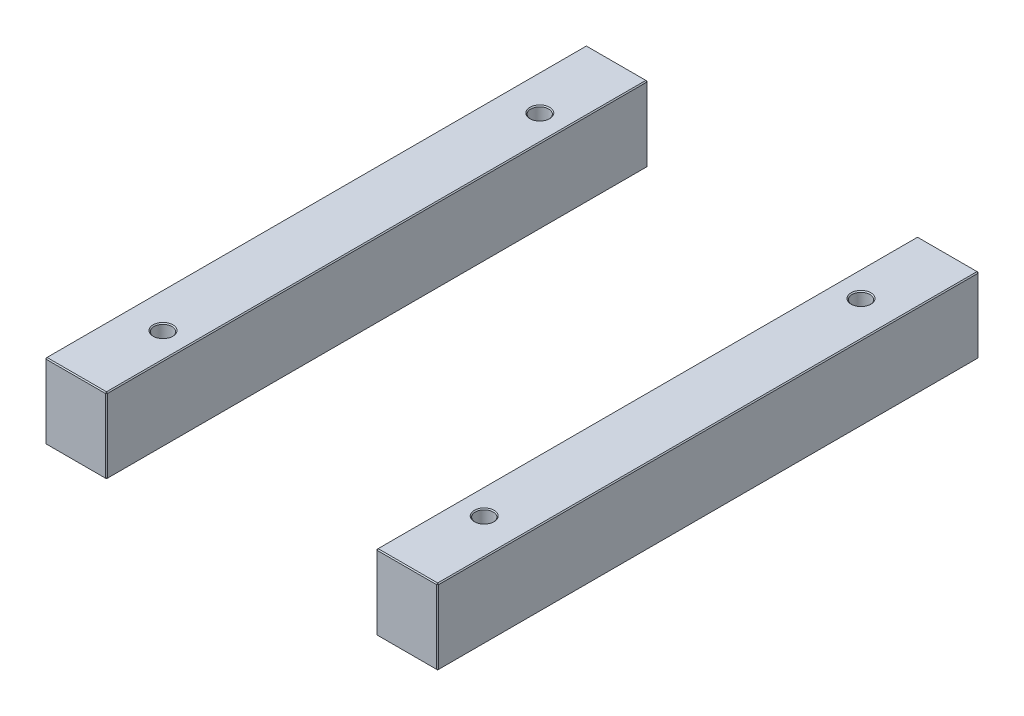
ISO-10303-21;
HEADER;
FILE_DESCRIPTION(('STEP AP214'),'2;1');
FILE_NAME('part.step','',(''),(''),'','','');
FILE_SCHEMA(('AUTOMOTIVE_DESIGN { 1 0 10303 214 1 1 1 1 }'));
ENDSEC;
DATA;
#1=APPLICATION_CONTEXT('core data for automotive mechanical design processes');
#2=APPLICATION_PROTOCOL_DEFINITION('international standard','automotive_design',2000,#1);
#3=PRODUCT_CONTEXT('',#1,'mechanical');
#4=PRODUCT('Part','Part','',(#3));
#5=PRODUCT_RELATED_PRODUCT_CATEGORY('part','',(#4));
#6=PRODUCT_DEFINITION_FORMATION('','',#4);
#7=PRODUCT_DEFINITION_CONTEXT('part definition',#1,'design');
#8=PRODUCT_DEFINITION('design','',#6,#7);
#9=PRODUCT_DEFINITION_SHAPE('','',#8);
#10=(LENGTH_UNIT() NAMED_UNIT(*) SI_UNIT(.MILLI.,.METRE.));
#11=(NAMED_UNIT(*) PLANE_ANGLE_UNIT() SI_UNIT($,.RADIAN.));
#12=(NAMED_UNIT(*) SI_UNIT($,.STERADIAN.) SOLID_ANGLE_UNIT());
#13=UNCERTAINTY_MEASURE_WITH_UNIT(LENGTH_MEASURE(1.E-05),#10,'distance_accuracy_value','');
#14=(GEOMETRIC_REPRESENTATION_CONTEXT(3) GLOBAL_UNCERTAINTY_ASSIGNED_CONTEXT((#13)) GLOBAL_UNIT_ASSIGNED_CONTEXT((#10,
#11,#12)) REPRESENTATION_CONTEXT('',''));
#15=CARTESIAN_POINT('',(0.,0.,0.));
#16=DIRECTION('',(0.,0.,1.));
#17=DIRECTION('',(1.,0.,0.));
#18=AXIS2_PLACEMENT_3D('',#15,#16,#17);
#19=CARTESIAN_POINT('',(-198.,76.,-273.));
#20=DIRECTION('',(0.,0.,1.));
#21=DIRECTION('',(1.,0.,0.));
#22=AXIS2_PLACEMENT_3D('',#19,#20,#21);
#23=PLANE('',#22);
#24=DIRECTION('',(-1.,0.,0.));
#25=VECTOR('',#24,1.);
#26=CARTESIAN_POINT('',(-198.,0.99999999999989,-273.));
#27=LINE('',#26,#25);
#28=CARTESIAN_POINT('',(-137.,0.99999999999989,-273.));
#29=VERTEX_POINT('',#28);
#30=CARTESIAN_POINT('',(-197.,0.99999999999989,-273.));
#31=VERTEX_POINT('',#30);
#32=EDGE_CURVE('P0_E137',#29,#31,#27,.T.);
#33=ORIENTED_EDGE('',*,*,#32,.T.);
#34=DIRECTION('',(0.,1.,0.));
#35=VECTOR('',#34,1.);
#36=CARTESIAN_POINT('',(-197.,76.,-273.));
#37=LINE('',#36,#35);
#38=CARTESIAN_POINT('',(-197.,75.,-273.));
#39=VERTEX_POINT('',#38);
#40=EDGE_CURVE('P0_E235',#31,#39,#37,.T.);
#41=ORIENTED_EDGE('',*,*,#40,.T.);
#42=DIRECTION('',(1.,0.,0.));
#43=VECTOR('',#42,1.);
#44=CARTESIAN_POINT('',(-198.,75.,-273.));
#45=LINE('',#44,#43);
#46=CARTESIAN_POINT('',(-137.,75.,-273.));
#47=VERTEX_POINT('',#46);
#48=EDGE_CURVE('P0_E233',#39,#47,#45,.T.);
#49=ORIENTED_EDGE('',*,*,#48,.T.);
#50=DIRECTION('',(0.,-1.,0.));
#51=VECTOR('',#50,1.);
#52=CARTESIAN_POINT('',(-137.,76.,-273.));
#53=LINE('',#52,#51);
#54=EDGE_CURVE('P0_E230',#47,#29,#53,.T.);
#55=ORIENTED_EDGE('',*,*,#54,.T.);
#56=EDGE_LOOP('',(#33,#41,#49,#55));
#57=FACE_BOUND('',#56,.T.);
#58=ADVANCED_FACE('P0_F16',(#57),#23,.F.);
#59=CARTESIAN_POINT('',(-198.,76.,273.));
#60=DIRECTION('',(1.,0.,0.));
#61=DIRECTION('',(0.,0.,-1.));
#62=AXIS2_PLACEMENT_3D('',#59,#60,#61);
#63=PLANE('',#62);
#64=DIRECTION('',(0.,1.,0.));
#65=VECTOR('',#64,1.);
#66=CARTESIAN_POINT('',(-198.,76.,272.));
#67=LINE('',#66,#65);
#68=CARTESIAN_POINT('',(-198.,0.99999999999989,272.));
#69=VERTEX_POINT('',#68);
#70=CARTESIAN_POINT('',(-198.,75.,272.));
#71=VERTEX_POINT('',#70);
#72=EDGE_CURVE('P0_E217',#69,#71,#67,.T.);
#73=ORIENTED_EDGE('',*,*,#72,.T.);
#74=DIRECTION('',(0.,0.,-1.));
#75=VECTOR('',#74,1.);
#76=CARTESIAN_POINT('',(-198.,75.,273.));
#77=LINE('',#76,#75);
#78=CARTESIAN_POINT('',(-198.,75.,-272.));
#79=VERTEX_POINT('',#78);
#80=EDGE_CURVE('P0_E228',#71,#79,#77,.T.);
#81=ORIENTED_EDGE('',*,*,#80,.T.);
#82=DIRECTION('',(0.,-1.,0.));
#83=VECTOR('',#82,1.);
#84=CARTESIAN_POINT('',(-198.,76.,-272.));
#85=LINE('',#84,#83);
#86=CARTESIAN_POINT('',(-198.,0.99999999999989,-272.));
#87=VERTEX_POINT('',#86);
#88=EDGE_CURVE('P0_E225',#79,#87,#85,.T.);
#89=ORIENTED_EDGE('',*,*,#88,.T.);
#90=DIRECTION('',(0.,0.,1.));
#91=VECTOR('',#90,1.);
#92=CARTESIAN_POINT('',(-198.,0.99999999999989,273.));
#93=LINE('',#92,#91);
#94=EDGE_CURVE('P0_E214',#87,#69,#93,.T.);
#95=ORIENTED_EDGE('',*,*,#94,.T.);
#96=EDGE_LOOP('',(#73,#81,#89,#95));
#97=FACE_BOUND('',#96,.T.);
#98=ADVANCED_FACE('P0_F302',(#97),#63,.F.);
#99=CARTESIAN_POINT('',(-198.,76.,273.));
#100=DIRECTION('',(0.,0.,-1.));
#101=DIRECTION('',(-1.,0.,0.));
#102=AXIS2_PLACEMENT_3D('',#99,#100,#101);
#103=PLANE('',#102);
#104=DIRECTION('',(-1.,0.,0.));
#105=VECTOR('',#104,1.);
#106=CARTESIAN_POINT('',(-198.,75.,273.));
#107=LINE('',#106,#105);
#108=CARTESIAN_POINT('',(-137.,75.,273.));
#109=VERTEX_POINT('',#108);
#110=CARTESIAN_POINT('',(-197.,75.,273.));
#111=VERTEX_POINT('',#110);
#112=EDGE_CURVE('P0_E242',#109,#111,#107,.T.);
#113=ORIENTED_EDGE('',*,*,#112,.T.);
#114=DIRECTION('',(0.,-1.,0.));
#115=VECTOR('',#114,1.);
#116=CARTESIAN_POINT('',(-197.,76.,273.));
#117=LINE('',#116,#115);
#118=CARTESIAN_POINT('',(-197.,0.99999999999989,273.));
#119=VERTEX_POINT('',#118);
#120=EDGE_CURVE('P0_E244',#111,#119,#117,.T.);
#121=ORIENTED_EDGE('',*,*,#120,.T.);
#122=DIRECTION('',(1.,0.,0.));
#123=VECTOR('',#122,1.);
#124=CARTESIAN_POINT('',(-136.,0.99999999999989,273.));
#125=LINE('',#124,#123);
#126=CARTESIAN_POINT('',(-137.,0.99999999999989,273.));
#127=VERTEX_POINT('',#126);
#128=EDGE_CURVE('P0_E240',#119,#127,#125,.T.);
#129=ORIENTED_EDGE('',*,*,#128,.T.);
#130=DIRECTION('',(0.,1.,0.));
#131=VECTOR('',#130,1.);
#132=CARTESIAN_POINT('',(-137.,76.,273.));
#133=LINE('',#132,#131);
#134=EDGE_CURVE('P0_E238',#127,#109,#133,.T.);
#135=ORIENTED_EDGE('',*,*,#134,.T.);
#136=EDGE_LOOP('',(#113,#121,#129,#135));
#137=FACE_BOUND('',#136,.T.);
#138=ADVANCED_FACE('P0_F341',(#137),#103,.F.);
#139=CARTESIAN_POINT('',(-136.,76.,-273.));
#140=DIRECTION('',(-1.,0.,0.));
#141=DIRECTION('',(0.,0.,1.));
#142=AXIS2_PLACEMENT_3D('',#139,#140,#141);
#143=PLANE('',#142);
#144=DIRECTION('',(0.,0.,1.));
#145=VECTOR('',#144,1.);
#146=CARTESIAN_POINT('',(-136.,75.,-273.));
#147=LINE('',#146,#145);
#148=CARTESIAN_POINT('',(-136.,75.,-272.));
#149=VERTEX_POINT('',#148);
#150=CARTESIAN_POINT('',(-136.,75.,272.));
#151=VERTEX_POINT('',#150);
#152=EDGE_CURVE('P0_E31',#149,#151,#147,.T.);
#153=ORIENTED_EDGE('',*,*,#152,.T.);
#154=DIRECTION('',(0.,-1.,0.));
#155=VECTOR('',#154,1.);
#156=CARTESIAN_POINT('',(-136.,76.,272.));
#157=LINE('',#156,#155);
#158=CARTESIAN_POINT('',(-136.,0.99999999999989,272.));
#159=VERTEX_POINT('',#158);
#160=EDGE_CURVE('P0_E190',#151,#159,#157,.T.);
#161=ORIENTED_EDGE('',*,*,#160,.T.);
#162=DIRECTION('',(0.,0.,-1.));
#163=VECTOR('',#162,1.);
#164=CARTESIAN_POINT('',(-136.,0.99999999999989,-273.));
#165=LINE('',#164,#163);
#166=CARTESIAN_POINT('',(-136.,0.99999999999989,-272.));
#167=VERTEX_POINT('',#166);
#168=EDGE_CURVE('P0_E256',#159,#167,#165,.T.);
#169=ORIENTED_EDGE('',*,*,#168,.T.);
#170=DIRECTION('',(0.,1.,0.));
#171=VECTOR('',#170,1.);
#172=CARTESIAN_POINT('',(-136.,76.,-272.));
#173=LINE('',#172,#171);
#174=EDGE_CURVE('P0_E36',#167,#149,#173,.T.);
#175=ORIENTED_EDGE('',*,*,#174,.T.);
#176=EDGE_LOOP('',(#153,#161,#169,#175));
#177=FACE_BOUND('',#176,.T.);
#178=ADVANCED_FACE('P0_F535',(#177),#143,.F.);
#179=CARTESIAN_POINT('',(0.,76.,0.));
#180=DIRECTION('',(0.,-1.,0.));
#181=DIRECTION('',(0.,0.,-1.));
#182=AXIS2_PLACEMENT_3D('',#179,#180,#181);
#183=PLANE('',#182);
#184=CARTESIAN_POINT('',(-162.,76.,190.));
#185=DIRECTION('',(0.,-1.,0.));
#186=DIRECTION('',(0.,0.,-1.));
#187=AXIS2_PLACEMENT_3D('',#184,#185,#186);
#188=CIRCLE('',#187,10.);
#189=CARTESIAN_POINT('',(-162.,76.,180.));
#190=VERTEX_POINT('',#189);
#191=EDGE_CURVE('P0_E24',#190,#190,#188,.T.);
#192=ORIENTED_EDGE('',*,*,#191,.T.);
#193=EDGE_LOOP('',(#192));
#194=FACE_BOUND('',#193,.T.);
#195=CARTESIAN_POINT('',(-162.,76.,-190.));
#196=DIRECTION('',(0.,-1.,0.));
#197=DIRECTION('',(0.,0.,-1.));
#198=AXIS2_PLACEMENT_3D('',#195,#196,#197);
#199=CIRCLE('',#198,10.);
#200=CARTESIAN_POINT('',(-162.,76.,-200.));
#201=VERTEX_POINT('',#200);
#202=EDGE_CURVE('P0_E189',#201,#201,#199,.T.);
#203=ORIENTED_EDGE('',*,*,#202,.T.);
#204=EDGE_LOOP('',(#203));
#205=FACE_BOUND('',#204,.T.);
#206=DIRECTION('',(0.,0.,1.));
#207=VECTOR('',#206,1.);
#208=CARTESIAN_POINT('',(-197.,76.,1.10158117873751E-13));
#209=LINE('',#208,#207);
#210=CARTESIAN_POINT('',(-197.,76.,-272.));
#211=VERTEX_POINT('',#210);
#212=CARTESIAN_POINT('',(-197.,76.,272.));
#213=VERTEX_POINT('',#212);
#214=EDGE_CURVE('P0_E251',#211,#213,#209,.T.);
#215=ORIENTED_EDGE('',*,*,#214,.T.);
#216=DIRECTION('',(1.,0.,0.));
#217=VECTOR('',#216,1.);
#218=CARTESIAN_POINT('',(0.,76.,272.));
#219=LINE('',#218,#217);
#220=CARTESIAN_POINT('',(-137.,76.,272.));
#221=VERTEX_POINT('',#220);
#222=EDGE_CURVE('P0_E253',#213,#221,#219,.T.);
#223=ORIENTED_EDGE('',*,*,#222,.T.);
#224=DIRECTION('',(0.,0.,-1.));
#225=VECTOR('',#224,1.);
#226=CARTESIAN_POINT('',(-137.,76.,0.));
#227=LINE('',#226,#225);
#228=CARTESIAN_POINT('',(-137.,76.,-272.));
#229=VERTEX_POINT('',#228);
#230=EDGE_CURVE('P0_E247',#221,#229,#227,.T.);
#231=ORIENTED_EDGE('',*,*,#230,.T.);
#232=DIRECTION('',(-1.,0.,0.));
#233=VECTOR('',#232,1.);
#234=CARTESIAN_POINT('',(0.,76.,-272.));
#235=LINE('',#234,#233);
#236=EDGE_CURVE('P0_E249',#229,#211,#235,.T.);
#237=ORIENTED_EDGE('',*,*,#236,.T.);
#238=EDGE_LOOP('',(#215,#223,#231,#237));
#239=FACE_BOUND('',#238,.T.);
#240=ADVANCED_FACE('P0_F195',(#194,#205,#239),#183,.F.);
#241=CARTESIAN_POINT('',(0.,0.,0.));
#242=DIRECTION('',(0.,-1.,0.));
#243=DIRECTION('',(0.,0.,-1.));
#244=AXIS2_PLACEMENT_3D('',#241,#242,#243);
#245=PLANE('',#244);
#246=CARTESIAN_POINT('',(-162.,0.,-190.));
#247=DIRECTION('',(0.,-1.,0.));
#248=DIRECTION('',(0.,0.,-1.));
#249=AXIS2_PLACEMENT_3D('',#246,#247,#248);
#250=CIRCLE('',#249,9.99999999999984);
#251=CARTESIAN_POINT('',(-162.,0.,-200.));
#252=VERTEX_POINT('',#251);
#253=EDGE_CURVE('P0_E220',#252,#252,#250,.F.);
#254=ORIENTED_EDGE('',*,*,#253,.T.);
#255=EDGE_LOOP('',(#254));
#256=FACE_BOUND('',#255,.T.);
#257=CARTESIAN_POINT('',(-162.,0.,190.));
#258=DIRECTION('',(0.,-1.,0.));
#259=DIRECTION('',(0.,0.,-1.));
#260=AXIS2_PLACEMENT_3D('',#257,#258,#259);
#261=CIRCLE('',#260,9.99999999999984);
#262=CARTESIAN_POINT('',(-162.,0.,180.));
#263=VERTEX_POINT('',#262);
#264=EDGE_CURVE('P0_E608',#263,#263,#261,.F.);
#265=ORIENTED_EDGE('',*,*,#264,.T.);
#266=EDGE_LOOP('',(#265));
#267=FACE_BOUND('',#266,.T.);
#268=DIRECTION('',(-1.,0.,0.));
#269=VECTOR('',#268,1.);
#270=CARTESIAN_POINT('',(-198.,0.,272.));
#271=LINE('',#270,#269);
#272=CARTESIAN_POINT('',(-137.,0.,272.));
#273=VERTEX_POINT('',#272);
#274=CARTESIAN_POINT('',(-197.,0.,272.));
#275=VERTEX_POINT('',#274);
#276=EDGE_CURVE('P0_E114',#273,#275,#271,.T.);
#277=ORIENTED_EDGE('',*,*,#276,.T.);
#278=DIRECTION('',(0.,0.,-1.));
#279=VECTOR('',#278,1.);
#280=CARTESIAN_POINT('',(-197.,0.,-273.));
#281=LINE('',#280,#279);
#282=CARTESIAN_POINT('',(-197.,0.,-272.));
#283=VERTEX_POINT('',#282);
#284=EDGE_CURVE('P0_E110',#275,#283,#281,.T.);
#285=ORIENTED_EDGE('',*,*,#284,.T.);
#286=DIRECTION('',(1.,0.,0.));
#287=VECTOR('',#286,1.);
#288=CARTESIAN_POINT('',(-136.,0.,-272.));
#289=LINE('',#288,#287);
#290=CARTESIAN_POINT('',(-137.,0.,-272.));
#291=VERTEX_POINT('',#290);
#292=EDGE_CURVE('P0_E104',#283,#291,#289,.T.);
#293=ORIENTED_EDGE('',*,*,#292,.T.);
#294=DIRECTION('',(0.,0.,1.));
#295=VECTOR('',#294,1.);
#296=CARTESIAN_POINT('',(-137.,0.,273.));
#297=LINE('',#296,#295);
#298=EDGE_CURVE('P0_E107',#291,#273,#297,.T.);
#299=ORIENTED_EDGE('',*,*,#298,.T.);
#300=EDGE_LOOP('',(#277,#285,#293,#299));
#301=FACE_BOUND('',#300,.T.);
#302=ADVANCED_FACE('P0_F106',(#256,#267,#301),#245,.T.);
#303=CARTESIAN_POINT('',(-162.,0.,-190.));
#304=DIRECTION('',(0.,1.,0.));
#305=DIRECTION('',(0.,0.,1.));
#306=AXIS2_PLACEMENT_3D('',#303,#304,#305);
#307=CYLINDRICAL_SURFACE('',#306,9.);
#308=CARTESIAN_POINT('',(-162.,75.,-190.));
#309=DIRECTION('',(0.,-1.,0.));
#310=DIRECTION('',(0.,0.,-1.));
#311=AXIS2_PLACEMENT_3D('',#308,#309,#310);
#312=CIRCLE('',#311,9.);
#313=CARTESIAN_POINT('',(-162.,75.,-199.));
#314=VERTEX_POINT('',#313);
#315=EDGE_CURVE('P0_E10',#314,#314,#312,.F.);
#316=ORIENTED_EDGE('',*,*,#315,.T.);
#317=EDGE_LOOP('',(#316));
#318=FACE_BOUND('',#317,.T.);
#319=CARTESIAN_POINT('',(-162.,0.999999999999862,-190.));
#320=DIRECTION('',(0.,-1.,0.));
#321=DIRECTION('',(0.,0.,-1.));
#322=AXIS2_PLACEMENT_3D('',#319,#320,#321);
#323=CIRCLE('',#322,9.);
#324=CARTESIAN_POINT('',(-162.,0.999999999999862,-199.));
#325=VERTEX_POINT('',#324);
#326=EDGE_CURVE('P0_E215',#325,#325,#323,.T.);
#327=ORIENTED_EDGE('',*,*,#326,.T.);
#328=EDGE_LOOP('',(#327));
#329=FACE_BOUND('',#328,.T.);
#330=ADVANCED_FACE('P0_F208',(#318,#329),#307,.F.);
#331=CARTESIAN_POINT('',(-162.,0.,190.));
#332=DIRECTION('',(0.,1.,0.));
#333=DIRECTION('',(0.,0.,1.));
#334=AXIS2_PLACEMENT_3D('',#331,#332,#333);
#335=CYLINDRICAL_SURFACE('',#334,9.);
#336=CARTESIAN_POINT('',(-162.,75.,190.));
#337=DIRECTION('',(0.,-1.,0.));
#338=DIRECTION('',(0.,0.,-1.));
#339=AXIS2_PLACEMENT_3D('',#336,#337,#338);
#340=CIRCLE('',#339,9.);
#341=CARTESIAN_POINT('',(-162.,75.,181.));
#342=VERTEX_POINT('',#341);
#343=EDGE_CURVE('P0_E186',#342,#342,#340,.F.);
#344=ORIENTED_EDGE('',*,*,#343,.T.);
#345=EDGE_LOOP('',(#344));
#346=FACE_BOUND('',#345,.T.);
#347=CARTESIAN_POINT('',(-162.,0.999999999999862,190.));
#348=DIRECTION('',(0.,-1.,0.));
#349=DIRECTION('',(0.,0.,-1.));
#350=AXIS2_PLACEMENT_3D('',#347,#348,#349);
#351=CIRCLE('',#350,9.);
#352=CARTESIAN_POINT('',(-162.,0.999999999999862,181.));
#353=VERTEX_POINT('',#352);
#354=EDGE_CURVE('P0_E212',#353,#353,#351,.T.);
#355=ORIENTED_EDGE('',*,*,#354,.T.);
#356=EDGE_LOOP('',(#355));
#357=FACE_BOUND('',#356,.T.);
#358=ADVANCED_FACE('P0_F204',(#346,#357),#335,.F.);
#359=CARTESIAN_POINT('',(-162.,0.,-190.));
#360=DIRECTION('',(0.,-1.,0.));
#361=DIRECTION('',(0.,0.,-1.));
#362=AXIS2_PLACEMENT_3D('',#359,#360,#361);
#363=CONICAL_SURFACE('',#362,9.99999999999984,0.785398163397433);
#364=ORIENTED_EDGE('',*,*,#326,.F.);
#365=EDGE_LOOP('',(#364));
#366=FACE_BOUND('',#365,.T.);
#367=ORIENTED_EDGE('',*,*,#253,.F.);
#368=EDGE_LOOP('',(#367));
#369=FACE_BOUND('',#368,.T.);
#370=ADVANCED_FACE('P0_F207',(#366,#369),#363,.F.);
#371=CARTESIAN_POINT('',(-162.,0.,190.));
#372=DIRECTION('',(0.,-1.,0.));
#373=DIRECTION('',(0.,0.,-1.));
#374=AXIS2_PLACEMENT_3D('',#371,#372,#373);
#375=CONICAL_SURFACE('',#374,9.99999999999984,0.785398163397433);
#376=ORIENTED_EDGE('',*,*,#354,.F.);
#377=EDGE_LOOP('',(#376));
#378=FACE_BOUND('',#377,.T.);
#379=ORIENTED_EDGE('',*,*,#264,.F.);
#380=EDGE_LOOP('',(#379));
#381=FACE_BOUND('',#380,.T.);
#382=ADVANCED_FACE('P0_F347',(#378,#381),#375,.F.);
#383=CARTESIAN_POINT('',(-136.,76.,272.));
#384=DIRECTION('',(-0.707106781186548,0.,-0.707106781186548));
#385=DIRECTION('',(0.,-1.,0.));
#386=AXIS2_PLACEMENT_3D('',#383,#384,#385);
#387=PLANE('',#386);
#388=DIRECTION('',(-0.707106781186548,0.,0.707106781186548));
#389=VECTOR('',#388,1.);
#390=CARTESIAN_POINT('',(-136.5,75.,272.5));
#391=LINE('',#390,#389);
#392=EDGE_CURVE('P0_E125',#109,#151,#391,.F.);
#393=ORIENTED_EDGE('',*,*,#392,.F.);
#394=ORIENTED_EDGE('',*,*,#134,.F.);
#395=DIRECTION('',(0.707106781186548,0.,-0.707106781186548));
#396=VECTOR('',#395,1.);
#397=CARTESIAN_POINT('',(-137.,0.99999999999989,273.));
#398=LINE('',#397,#396);
#399=EDGE_CURVE('P0_E181',#159,#127,#398,.F.);
#400=ORIENTED_EDGE('',*,*,#399,.F.);
#401=ORIENTED_EDGE('',*,*,#160,.F.);
#402=EDGE_LOOP('',(#393,#394,#400,#401));
#403=FACE_BOUND('',#402,.T.);
#404=ADVANCED_FACE('P0_F351',(#403),#387,.F.);
#405=CARTESIAN_POINT('',(-137.,76.,272.));
#406=DIRECTION('',(0.577350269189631,0.577350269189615,0.577350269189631));
#407=DIRECTION('',(0.707106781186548,0.,-0.707106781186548));
#408=AXIS2_PLACEMENT_3D('',#405,#406,#407);
#409=PLANE('',#408);
#410=DIRECTION('',(0.,0.707106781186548,-0.707106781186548));
#411=VECTOR('',#410,1.);
#412=CARTESIAN_POINT('',(-137.,76.,272.));
#413=LINE('',#412,#411);
#414=EDGE_CURVE('P0_E175',#109,#221,#413,.T.);
#415=ORIENTED_EDGE('',*,*,#414,.F.);
#416=ORIENTED_EDGE('',*,*,#392,.T.);
#417=DIRECTION('',(0.707106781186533,-0.707106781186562,0.));
#418=VECTOR('',#417,1.);
#419=CARTESIAN_POINT('',(-137.,76.,272.));
#420=LINE('',#419,#418);
#421=EDGE_CURVE('P0_E178',#221,#151,#420,.T.);
#422=ORIENTED_EDGE('',*,*,#421,.F.);
#423=EDGE_LOOP('',(#415,#416,#422));
#424=FACE_BOUND('',#423,.T.);
#425=ADVANCED_FACE('P0_F487',(#424),#409,.T.);
#426=CARTESIAN_POINT('',(-137.,0.99999999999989,273.));
#427=DIRECTION('',(0.577350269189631,-0.577350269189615,0.577350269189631));
#428=DIRECTION('',(0.707106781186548,0.,-0.707106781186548));
#429=AXIS2_PLACEMENT_3D('',#426,#427,#428);
#430=PLANE('',#429);
#431=DIRECTION('',(0.707106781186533,0.707106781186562,0.));
#432=VECTOR('',#431,1.);
#433=CARTESIAN_POINT('',(-136.5,0.499999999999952,272.));
#434=LINE('',#433,#432);
#435=EDGE_CURVE('P0_E123',#159,#273,#434,.F.);
#436=ORIENTED_EDGE('',*,*,#435,.F.);
#437=ORIENTED_EDGE('',*,*,#399,.T.);
#438=DIRECTION('',(0.,-0.707106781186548,-0.707106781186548));
#439=VECTOR('',#438,1.);
#440=CARTESIAN_POINT('',(-137.,0.99999999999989,273.));
#441=LINE('',#440,#439);
#442=EDGE_CURVE('P0_E172',#273,#127,#441,.F.);
#443=ORIENTED_EDGE('',*,*,#442,.F.);
#444=EDGE_LOOP('',(#436,#437,#443));
#445=FACE_BOUND('',#444,.T.);
#446=ADVANCED_FACE('P0_F478',(#445),#430,.T.);
#447=CARTESIAN_POINT('',(-137.,76.,0.));
#448=DIRECTION('',(-0.707106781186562,-0.707106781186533,0.));
#449=DIRECTION('',(0.,0.,-1.));
#450=AXIS2_PLACEMENT_3D('',#447,#448,#449);
#451=PLANE('',#450);
#452=ORIENTED_EDGE('',*,*,#421,.T.);
#453=ORIENTED_EDGE('',*,*,#152,.F.);
#454=DIRECTION('',(-0.707106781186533,0.707106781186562,0.));
#455=VECTOR('',#454,1.);
#456=CARTESIAN_POINT('',(-136.5,75.5,-272.));
#457=LINE('',#456,#455);
#458=EDGE_CURVE('P0_E165',#229,#149,#457,.F.);
#459=ORIENTED_EDGE('',*,*,#458,.F.);
#460=ORIENTED_EDGE('',*,*,#230,.F.);
#461=EDGE_LOOP('',(#452,#453,#459,#460));
#462=FACE_BOUND('',#461,.T.);
#463=ADVANCED_FACE('P0_F318',(#462),#451,.F.);
#464=CARTESIAN_POINT('',(0.,76.,272.));
#465=DIRECTION('',(0.,-0.707106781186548,-0.707106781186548));
#466=DIRECTION('',(1.,0.,0.));
#467=AXIS2_PLACEMENT_3D('',#464,#465,#466);
#468=PLANE('',#467);
#469=ORIENTED_EDGE('',*,*,#414,.T.);
#470=ORIENTED_EDGE('',*,*,#222,.F.);
#471=DIRECTION('',(0.,-0.707106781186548,0.707106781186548));
#472=VECTOR('',#471,1.);
#473=CARTESIAN_POINT('',(-197.,75.5,272.5));
#474=LINE('',#473,#472);
#475=EDGE_CURVE('P0_E162',#111,#213,#474,.F.);
#476=ORIENTED_EDGE('',*,*,#475,.F.);
#477=ORIENTED_EDGE('',*,*,#112,.F.);
#478=EDGE_LOOP('',(#469,#470,#476,#477));
#479=FACE_BOUND('',#478,.T.);
#480=ADVANCED_FACE('P0_F313',(#479),#468,.F.);
#481=CARTESIAN_POINT('',(-197.,76.,273.));
#482=DIRECTION('',(0.707106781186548,0.,-0.707106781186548));
#483=DIRECTION('',(0.,-1.,0.));
#484=AXIS2_PLACEMENT_3D('',#481,#482,#483);
#485=PLANE('',#484);
#486=DIRECTION('',(0.707106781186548,0.,0.707106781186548));
#487=VECTOR('',#486,1.);
#488=CARTESIAN_POINT('',(-197.,0.99999999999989,273.));
#489=LINE('',#488,#487);
#490=EDGE_CURVE('P0_E156',#119,#69,#489,.F.);
#491=ORIENTED_EDGE('',*,*,#490,.F.);
#492=ORIENTED_EDGE('',*,*,#120,.F.);
#493=DIRECTION('',(-0.707106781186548,0.,-0.707106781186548));
#494=VECTOR('',#493,1.);
#495=CARTESIAN_POINT('',(-198.,75.,272.));
#496=LINE('',#495,#494);
#497=EDGE_CURVE('P0_E159',#71,#111,#496,.F.);
#498=ORIENTED_EDGE('',*,*,#497,.F.);
#499=ORIENTED_EDGE('',*,*,#72,.F.);
#500=EDGE_LOOP('',(#491,#492,#498,#499));
#501=FACE_BOUND('',#500,.T.);
#502=ADVANCED_FACE('P0_F307',(#501),#485,.F.);
#503=CARTESIAN_POINT('',(-198.,0.99999999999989,273.));
#504=DIRECTION('',(0.,-0.707106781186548,0.707106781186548));
#505=DIRECTION('',(-1.,0.,0.));
#506=AXIS2_PLACEMENT_3D('',#503,#504,#505);
#507=PLANE('',#506);
#508=ORIENTED_EDGE('',*,*,#442,.T.);
#509=ORIENTED_EDGE('',*,*,#128,.F.);
#510=DIRECTION('',(0.,0.707106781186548,0.707106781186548));
#511=VECTOR('',#510,1.);
#512=CARTESIAN_POINT('',(-197.,0.99999999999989,273.));
#513=LINE('',#512,#511);
#514=EDGE_CURVE('P0_E134',#275,#119,#513,.T.);
#515=ORIENTED_EDGE('',*,*,#514,.F.);
#516=ORIENTED_EDGE('',*,*,#276,.F.);
#517=EDGE_LOOP('',(#508,#509,#515,#516));
#518=FACE_BOUND('',#517,.T.);
#519=ADVANCED_FACE('P0_F333',(#518),#507,.T.);
#520=CARTESIAN_POINT('',(-136.,0.99999999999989,-273.));
#521=DIRECTION('',(0.707106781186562,-0.707106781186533,0.));
#522=DIRECTION('',(0.,0.,1.));
#523=AXIS2_PLACEMENT_3D('',#520,#521,#522);
#524=PLANE('',#523);
#525=ORIENTED_EDGE('',*,*,#435,.T.);
#526=ORIENTED_EDGE('',*,*,#298,.F.);
#527=DIRECTION('',(-0.707106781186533,-0.707106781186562,0.));
#528=VECTOR('',#527,1.);
#529=CARTESIAN_POINT('',(-137.,0.,-272.));
#530=LINE('',#529,#528);
#531=EDGE_CURVE('P0_E120',#167,#291,#530,.T.);
#532=ORIENTED_EDGE('',*,*,#531,.F.);
#533=ORIENTED_EDGE('',*,*,#168,.F.);
#534=EDGE_LOOP('',(#525,#526,#532,#533));
#535=FACE_BOUND('',#534,.T.);
#536=ADVANCED_FACE('P0_F119',(#535),#524,.T.);
#537=CARTESIAN_POINT('',(-137.,76.,-273.));
#538=DIRECTION('',(-0.707106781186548,0.,0.707106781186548));
#539=DIRECTION('',(0.,-1.,0.));
#540=AXIS2_PLACEMENT_3D('',#537,#538,#539);
#541=PLANE('',#540);
#542=DIRECTION('',(0.707106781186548,0.,0.707106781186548));
#543=VECTOR('',#542,1.);
#544=CARTESIAN_POINT('',(-137.,75.,-273.));
#545=LINE('',#544,#543);
#546=EDGE_CURVE('P0_E168',#149,#47,#545,.F.);
#547=ORIENTED_EDGE('',*,*,#546,.F.);
#548=ORIENTED_EDGE('',*,*,#174,.F.);
#549=DIRECTION('',(-0.707106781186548,0.,-0.707106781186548));
#550=VECTOR('',#549,1.);
#551=CARTESIAN_POINT('',(-136.5,0.99999999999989,-272.5));
#552=LINE('',#551,#550);
#553=EDGE_CURVE('P0_E133',#29,#167,#552,.F.);
#554=ORIENTED_EDGE('',*,*,#553,.F.);
#555=ORIENTED_EDGE('',*,*,#54,.F.);
#556=EDGE_LOOP('',(#547,#548,#554,#555));
#557=FACE_BOUND('',#556,.T.);
#558=ADVANCED_FACE('P0_F323',(#557),#541,.F.);
#559=CARTESIAN_POINT('',(-137.,75.,-273.));
#560=DIRECTION('',(0.577350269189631,0.577350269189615,-0.577350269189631));
#561=DIRECTION('',(-0.707106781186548,0.,-0.707106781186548));
#562=AXIS2_PLACEMENT_3D('',#559,#560,#561);
#563=PLANE('',#562);
#564=ORIENTED_EDGE('',*,*,#458,.T.);
#565=ORIENTED_EDGE('',*,*,#546,.T.);
#566=DIRECTION('',(0.,-0.707106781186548,-0.707106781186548));
#567=VECTOR('',#566,1.);
#568=CARTESIAN_POINT('',(-137.,75.,-273.));
#569=LINE('',#568,#567);
#570=EDGE_CURVE('P0_E151',#229,#47,#569,.T.);
#571=ORIENTED_EDGE('',*,*,#570,.F.);
#572=EDGE_LOOP('',(#564,#565,#571));
#573=FACE_BOUND('',#572,.T.);
#574=ADVANCED_FACE('P0_F321',(#573),#563,.T.);
#575=CARTESIAN_POINT('',(-198.,75.,272.));
#576=DIRECTION('',(-0.577350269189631,0.577350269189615,0.577350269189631));
#577=DIRECTION('',(0.707106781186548,0.,0.707106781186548));
#578=AXIS2_PLACEMENT_3D('',#575,#576,#577);
#579=PLANE('',#578);
#580=ORIENTED_EDGE('',*,*,#497,.T.);
#581=ORIENTED_EDGE('',*,*,#475,.T.);
#582=DIRECTION('',(0.707106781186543,0.707106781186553,0.));
#583=VECTOR('',#582,1.);
#584=CARTESIAN_POINT('',(-198.,75.,272.));
#585=LINE('',#584,#583);
#586=EDGE_CURVE('P0_E142',#71,#213,#585,.T.);
#587=ORIENTED_EDGE('',*,*,#586,.F.);
#588=EDGE_LOOP('',(#580,#581,#587));
#589=FACE_BOUND('',#588,.T.);
#590=ADVANCED_FACE('P0_F310',(#589),#579,.T.);
#591=CARTESIAN_POINT('',(-197.,0.99999999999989,273.));
#592=DIRECTION('',(-0.577350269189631,-0.577350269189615,0.577350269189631));
#593=DIRECTION('',(0.707106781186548,0.,0.707106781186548));
#594=AXIS2_PLACEMENT_3D('',#591,#592,#593);
#595=PLANE('',#594);
#596=ORIENTED_EDGE('',*,*,#514,.T.);
#597=ORIENTED_EDGE('',*,*,#490,.T.);
#598=DIRECTION('',(0.707106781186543,-0.707106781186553,0.));
#599=VECTOR('',#598,1.);
#600=CARTESIAN_POINT('',(-197.5,0.499999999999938,272.));
#601=LINE('',#600,#599);
#602=EDGE_CURVE('P0_E138',#275,#69,#601,.F.);
#603=ORIENTED_EDGE('',*,*,#602,.F.);
#604=EDGE_LOOP('',(#596,#597,#603));
#605=FACE_BOUND('',#604,.T.);
#606=ADVANCED_FACE('P0_F368',(#605),#595,.T.);
#607=CARTESIAN_POINT('',(-137.,0.,-272.));
#608=DIRECTION('',(0.577350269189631,-0.577350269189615,-0.577350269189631));
#609=DIRECTION('',(-0.707106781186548,0.,-0.707106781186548));
#610=AXIS2_PLACEMENT_3D('',#607,#608,#609);
#611=PLANE('',#610);
#612=ORIENTED_EDGE('',*,*,#553,.T.);
#613=ORIENTED_EDGE('',*,*,#531,.T.);
#614=DIRECTION('',(0.,0.707106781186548,-0.707106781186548));
#615=VECTOR('',#614,1.);
#616=CARTESIAN_POINT('',(-137.,0.,-272.));
#617=LINE('',#616,#615);
#618=EDGE_CURVE('P0_E130',#29,#291,#617,.F.);
#619=ORIENTED_EDGE('',*,*,#618,.F.);
#620=EDGE_LOOP('',(#612,#613,#619));
#621=FACE_BOUND('',#620,.T.);
#622=ADVANCED_FACE('P0_F129',(#621),#611,.T.);
#623=CARTESIAN_POINT('',(0.,76.,-272.));
#624=DIRECTION('',(0.,-0.707106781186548,0.707106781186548));
#625=DIRECTION('',(-1.,0.,0.));
#626=AXIS2_PLACEMENT_3D('',#623,#624,#625);
#627=PLANE('',#626);
#628=ORIENTED_EDGE('',*,*,#570,.T.);
#629=ORIENTED_EDGE('',*,*,#48,.F.);
#630=DIRECTION('',(0.,0.707106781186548,0.707106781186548));
#631=VECTOR('',#630,1.);
#632=CARTESIAN_POINT('',(-197.,75.,-273.));
#633=LINE('',#632,#631);
#634=EDGE_CURVE('P0_E139',#211,#39,#633,.F.);
#635=ORIENTED_EDGE('',*,*,#634,.F.);
#636=ORIENTED_EDGE('',*,*,#236,.F.);
#637=EDGE_LOOP('',(#628,#629,#635,#636));
#638=FACE_BOUND('',#637,.T.);
#639=ADVANCED_FACE('P0_F286',(#638),#627,.F.);
#640=CARTESIAN_POINT('',(-197.,76.,1.10158117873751E-13));
#641=DIRECTION('',(0.707106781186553,-0.707106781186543,0.));
#642=DIRECTION('',(0.,0.,1.));
#643=AXIS2_PLACEMENT_3D('',#640,#641,#642);
#644=PLANE('',#643);
#645=ORIENTED_EDGE('',*,*,#586,.T.);
#646=ORIENTED_EDGE('',*,*,#214,.F.);
#647=DIRECTION('',(-0.707106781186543,-0.707106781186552,0.));
#648=VECTOR('',#647,1.);
#649=CARTESIAN_POINT('',(-197.5,75.5,-272.));
#650=LINE('',#649,#648);
#651=EDGE_CURVE('P0_E145',#79,#211,#650,.F.);
#652=ORIENTED_EDGE('',*,*,#651,.F.);
#653=ORIENTED_EDGE('',*,*,#80,.F.);
#654=EDGE_LOOP('',(#645,#646,#652,#653));
#655=FACE_BOUND('',#654,.T.);
#656=ADVANCED_FACE('P0_F280',(#655),#644,.F.);
#657=CARTESIAN_POINT('',(-198.,0.99999999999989,273.));
#658=DIRECTION('',(-0.707106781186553,-0.707106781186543,0.));
#659=DIRECTION('',(0.,0.,-1.));
#660=AXIS2_PLACEMENT_3D('',#657,#658,#659);
#661=PLANE('',#660);
#662=ORIENTED_EDGE('',*,*,#602,.T.);
#663=ORIENTED_EDGE('',*,*,#94,.F.);
#664=DIRECTION('',(-0.707106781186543,0.707106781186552,0.));
#665=VECTOR('',#664,1.);
#666=CARTESIAN_POINT('',(-198.,0.99999999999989,-272.));
#667=LINE('',#666,#665);
#668=EDGE_CURVE('P0_E267',#283,#87,#667,.T.);
#669=ORIENTED_EDGE('',*,*,#668,.F.);
#670=ORIENTED_EDGE('',*,*,#284,.F.);
#671=EDGE_LOOP('',(#662,#663,#669,#670));
#672=FACE_BOUND('',#671,.T.);
#673=ADVANCED_FACE('P0_F298',(#672),#661,.T.);
#674=CARTESIAN_POINT('',(-198.,0.99999999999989,-273.));
#675=DIRECTION('',(0.,-0.707106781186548,-0.707106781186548));
#676=DIRECTION('',(1.,0.,0.));
#677=AXIS2_PLACEMENT_3D('',#674,#675,#676);
#678=PLANE('',#677);
#679=ORIENTED_EDGE('',*,*,#618,.T.);
#680=ORIENTED_EDGE('',*,*,#292,.F.);
#681=DIRECTION('',(0.,-0.707106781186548,0.707106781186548));
#682=VECTOR('',#681,1.);
#683=CARTESIAN_POINT('',(-197.,0.499999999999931,-272.5));
#684=LINE('',#683,#682);
#685=EDGE_CURVE('P0_E265',#31,#283,#684,.T.);
#686=ORIENTED_EDGE('',*,*,#685,.F.);
#687=ORIENTED_EDGE('',*,*,#32,.F.);
#688=EDGE_LOOP('',(#679,#680,#686,#687));
#689=FACE_BOUND('',#688,.T.);
#690=ADVANCED_FACE('P0_F136',(#689),#678,.T.);
#691=CARTESIAN_POINT('',(-197.,75.,-273.));
#692=DIRECTION('',(-0.577350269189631,0.577350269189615,-0.577350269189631));
#693=DIRECTION('',(-0.707106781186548,0.,0.707106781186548));
#694=AXIS2_PLACEMENT_3D('',#691,#692,#693);
#695=PLANE('',#694);
#696=ORIENTED_EDGE('',*,*,#651,.T.);
#697=ORIENTED_EDGE('',*,*,#634,.T.);
#698=DIRECTION('',(0.707106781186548,0.,-0.707106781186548));
#699=VECTOR('',#698,1.);
#700=CARTESIAN_POINT('',(-197.,75.,-273.));
#701=LINE('',#700,#699);
#702=EDGE_CURVE('P0_E263',#79,#39,#701,.T.);
#703=ORIENTED_EDGE('',*,*,#702,.F.);
#704=EDGE_LOOP('',(#696,#697,#703));
#705=FACE_BOUND('',#704,.T.);
#706=ADVANCED_FACE('P0_F273',(#705),#695,.T.);
#707=CARTESIAN_POINT('',(-198.,0.99999999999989,-272.));
#708=DIRECTION('',(-0.577350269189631,-0.577350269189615,-0.577350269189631));
#709=DIRECTION('',(-0.707106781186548,0.,0.707106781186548));
#710=AXIS2_PLACEMENT_3D('',#707,#708,#709);
#711=PLANE('',#710);
#712=ORIENTED_EDGE('',*,*,#685,.T.);
#713=ORIENTED_EDGE('',*,*,#668,.T.);
#714=DIRECTION('',(-0.707106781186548,0.,0.707106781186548));
#715=VECTOR('',#714,1.);
#716=CARTESIAN_POINT('',(-198.,0.99999999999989,-272.));
#717=LINE('',#716,#715);
#718=EDGE_CURVE('P0_E261',#31,#87,#717,.T.);
#719=ORIENTED_EDGE('',*,*,#718,.F.);
#720=EDGE_LOOP('',(#712,#713,#719));
#721=FACE_BOUND('',#720,.T.);
#722=ADVANCED_FACE('P0_F294',(#721),#711,.T.);
#723=CARTESIAN_POINT('',(-198.,76.,-272.));
#724=DIRECTION('',(0.707106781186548,0.,0.707106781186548));
#725=DIRECTION('',(0.,-1.,0.));
#726=AXIS2_PLACEMENT_3D('',#723,#724,#725);
#727=PLANE('',#726);
#728=ORIENTED_EDGE('',*,*,#702,.T.);
#729=ORIENTED_EDGE('',*,*,#40,.F.);
#730=ORIENTED_EDGE('',*,*,#718,.T.);
#731=ORIENTED_EDGE('',*,*,#88,.F.);
#732=EDGE_LOOP('',(#728,#729,#730,#731));
#733=FACE_BOUND('',#732,.T.);
#734=ADVANCED_FACE('P0_F201',(#733),#727,.F.);
#735=CARTESIAN_POINT('',(-162.,75.,190.));
#736=DIRECTION('',(0.,1.,0.));
#737=DIRECTION('',(0.,0.,1.));
#738=AXIS2_PLACEMENT_3D('',#735,#736,#737);
#739=CONICAL_SURFACE('',#738,9.,0.78539816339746);
#740=ORIENTED_EDGE('',*,*,#191,.F.);
#741=EDGE_LOOP('',(#740));
#742=FACE_BOUND('',#741,.T.);
#743=ORIENTED_EDGE('',*,*,#343,.F.);
#744=EDGE_LOOP('',(#743));
#745=FACE_BOUND('',#744,.T.);
#746=ADVANCED_FACE('P0_F198',(#742,#745),#739,.F.);
#747=CARTESIAN_POINT('',(-162.,75.,-190.));
#748=DIRECTION('',(0.,1.,0.));
#749=DIRECTION('',(0.,0.,1.));
#750=AXIS2_PLACEMENT_3D('',#747,#748,#749);
#751=CONICAL_SURFACE('',#750,9.,0.78539816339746);
#752=ORIENTED_EDGE('',*,*,#202,.F.);
#753=EDGE_LOOP('',(#752));
#754=FACE_BOUND('',#753,.T.);
#755=ORIENTED_EDGE('',*,*,#315,.F.);
#756=EDGE_LOOP('',(#755));
#757=FACE_BOUND('',#756,.T.);
#758=ADVANCED_FACE('P0_F18',(#754,#757),#751,.F.);
#759=CLOSED_SHELL('',(#58,#98,#138,#178,#240,#302,#330,#358,#370,#382,#404,#425,#446,#463,#480,
#502,#519,#536,#558,#574,#590,#606,#622,#639,#656,#673,#690,#706,#722,#734,#746,#758));
#760=MANIFOLD_SOLID_BREP('P0_B1',#759);
#761=CARTESIAN_POINT('',(198.,76.,273.));
#762=DIRECTION('',(0.,0.,-1.));
#763=DIRECTION('',(-1.,0.,0.));
#764=AXIS2_PLACEMENT_3D('',#761,#762,#763);
#765=PLANE('',#764);
#766=DIRECTION('',(0.,-1.,0.));
#767=VECTOR('',#766,1.);
#768=CARTESIAN_POINT('',(137.,76.,273.));
#769=LINE('',#768,#767);
#770=CARTESIAN_POINT('',(137.,75.,273.));
#771=VERTEX_POINT('',#770);
#772=CARTESIAN_POINT('',(137.,0.999999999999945,273.));
#773=VERTEX_POINT('',#772);
#774=EDGE_CURVE('P1_E174',#771,#773,#769,.T.);
#775=ORIENTED_EDGE('',*,*,#774,.T.);
#776=DIRECTION('',(1.,0.,0.));
#777=VECTOR('',#776,1.);
#778=CARTESIAN_POINT('',(198.,0.999999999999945,273.));
#779=LINE('',#778,#777);
#780=CARTESIAN_POINT('',(197.,0.999999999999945,273.));
#781=VERTEX_POINT('',#780);
#782=EDGE_CURVE('P1_E176',#773,#781,#779,.T.);
#783=ORIENTED_EDGE('',*,*,#782,.T.);
#784=DIRECTION('',(0.,1.,0.));
#785=VECTOR('',#784,1.);
#786=CARTESIAN_POINT('',(197.,76.,273.));
#787=LINE('',#786,#785);
#788=CARTESIAN_POINT('',(197.,75.,273.));
#789=VERTEX_POINT('',#788);
#790=EDGE_CURVE('P1_E172',#781,#789,#787,.T.);
#791=ORIENTED_EDGE('',*,*,#790,.T.);
#792=DIRECTION('',(-1.,0.,0.));
#793=VECTOR('',#792,1.);
#794=CARTESIAN_POINT('',(136.,75.,273.));
#795=LINE('',#794,#793);
#796=EDGE_CURVE('P1_E170',#789,#771,#795,.T.);
#797=ORIENTED_EDGE('',*,*,#796,.T.);
#798=EDGE_LOOP('',(#775,#783,#791,#797));
#799=FACE_BOUND('',#798,.T.);
#800=ADVANCED_FACE('P1_F17',(#799),#765,.F.);
#801=CARTESIAN_POINT('',(198.,76.,273.));
#802=DIRECTION('',(-1.,0.,0.));
#803=DIRECTION('',(0.,0.,1.));
#804=AXIS2_PLACEMENT_3D('',#801,#802,#803);
#805=PLANE('',#804);
#806=DIRECTION('',(0.,0.,1.));
#807=VECTOR('',#806,1.);
#808=CARTESIAN_POINT('',(198.,75.,273.));
#809=LINE('',#808,#807);
#810=CARTESIAN_POINT('',(198.,75.,-272.));
#811=VERTEX_POINT('',#810);
#812=CARTESIAN_POINT('',(198.,75.,272.));
#813=VERTEX_POINT('',#812);
#814=EDGE_CURVE('P1_E188',#811,#813,#809,.T.);
#815=ORIENTED_EDGE('',*,*,#814,.T.);
#816=DIRECTION('',(0.,-1.,0.));
#817=VECTOR('',#816,1.);
#818=CARTESIAN_POINT('',(198.,76.,272.));
#819=LINE('',#818,#817);
#820=CARTESIAN_POINT('',(198.,0.999999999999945,272.));
#821=VERTEX_POINT('',#820);
#822=EDGE_CURVE('P1_E194',#813,#821,#819,.T.);
#823=ORIENTED_EDGE('',*,*,#822,.T.);
#824=DIRECTION('',(0.,0.,-1.));
#825=VECTOR('',#824,1.);
#826=CARTESIAN_POINT('',(198.,0.999999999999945,273.));
#827=LINE('',#826,#825);
#828=CARTESIAN_POINT('',(198.,0.999999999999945,-272.));
#829=VERTEX_POINT('',#828);
#830=EDGE_CURVE('P1_E192',#821,#829,#827,.T.);
#831=ORIENTED_EDGE('',*,*,#830,.T.);
#832=DIRECTION('',(0.,1.,0.));
#833=VECTOR('',#832,1.);
#834=CARTESIAN_POINT('',(198.,76.,-272.));
#835=LINE('',#834,#833);
#836=EDGE_CURVE('P1_E190',#829,#811,#835,.T.);
#837=ORIENTED_EDGE('',*,*,#836,.T.);
#838=EDGE_LOOP('',(#815,#823,#831,#837));
#839=FACE_BOUND('',#838,.T.);
#840=ADVANCED_FACE('P1_F276',(#839),#805,.F.);
#841=CARTESIAN_POINT('',(198.,76.,-273.));
#842=DIRECTION('',(0.,0.,1.));
#843=DIRECTION('',(1.,0.,0.));
#844=AXIS2_PLACEMENT_3D('',#841,#842,#843);
#845=PLANE('',#844);
#846=DIRECTION('',(0.,-1.,0.));
#847=VECTOR('',#846,1.);
#848=CARTESIAN_POINT('',(197.,76.,-273.));
#849=LINE('',#848,#847);
#850=CARTESIAN_POINT('',(197.,75.,-273.));
#851=VERTEX_POINT('',#850);
#852=CARTESIAN_POINT('',(197.,0.999999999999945,-273.));
#853=VERTEX_POINT('',#852);
#854=EDGE_CURVE('P1_E165',#851,#853,#849,.T.);
#855=ORIENTED_EDGE('',*,*,#854,.T.);
#856=DIRECTION('',(-1.,0.,0.));
#857=VECTOR('',#856,1.);
#858=CARTESIAN_POINT('',(198.,0.999999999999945,-273.));
#859=LINE('',#858,#857);
#860=CARTESIAN_POINT('',(137.,0.999999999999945,-273.));
#861=VERTEX_POINT('',#860);
#862=EDGE_CURVE('P1_E113',#853,#861,#859,.T.);
#863=ORIENTED_EDGE('',*,*,#862,.T.);
#864=DIRECTION('',(0.,1.,0.));
#865=VECTOR('',#864,1.);
#866=CARTESIAN_POINT('',(137.,76.,-273.));
#867=LINE('',#866,#865);
#868=CARTESIAN_POINT('',(137.,75.,-273.));
#869=VERTEX_POINT('',#868);
#870=EDGE_CURVE('P1_E167',#861,#869,#867,.T.);
#871=ORIENTED_EDGE('',*,*,#870,.T.);
#872=DIRECTION('',(1.,0.,0.));
#873=VECTOR('',#872,1.);
#874=CARTESIAN_POINT('',(198.,75.,-273.));
#875=LINE('',#874,#873);
#876=EDGE_CURVE('P1_E163',#869,#851,#875,.T.);
#877=ORIENTED_EDGE('',*,*,#876,.T.);
#878=EDGE_LOOP('',(#855,#863,#871,#877));
#879=FACE_BOUND('',#878,.T.);
#880=ADVANCED_FACE('P1_F333',(#879),#845,.F.);
#881=CARTESIAN_POINT('',(136.,76.,-273.));
#882=DIRECTION('',(1.,0.,0.));
#883=DIRECTION('',(0.,0.,-1.));
#884=AXIS2_PLACEMENT_3D('',#881,#882,#883);
#885=PLANE('',#884);
#886=DIRECTION('',(0.,0.,-1.));
#887=VECTOR('',#886,1.);
#888=CARTESIAN_POINT('',(136.,75.,-273.));
#889=LINE('',#888,#887);
#890=CARTESIAN_POINT('',(136.,75.,272.));
#891=VERTEX_POINT('',#890);
#892=CARTESIAN_POINT('',(136.,75.,-272.));
#893=VERTEX_POINT('',#892);
#894=EDGE_CURVE('P1_E179',#891,#893,#889,.T.);
#895=ORIENTED_EDGE('',*,*,#894,.T.);
#896=DIRECTION('',(0.,-1.,0.));
#897=VECTOR('',#896,1.);
#898=CARTESIAN_POINT('',(136.,76.,-272.));
#899=LINE('',#898,#897);
#900=CARTESIAN_POINT('',(136.,0.999999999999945,-272.));
#901=VERTEX_POINT('',#900);
#902=EDGE_CURVE('P1_E185',#893,#901,#899,.T.);
#903=ORIENTED_EDGE('',*,*,#902,.T.);
#904=DIRECTION('',(0.,0.,1.));
#905=VECTOR('',#904,1.);
#906=CARTESIAN_POINT('',(136.,0.999999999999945,-273.));
#907=LINE('',#906,#905);
#908=CARTESIAN_POINT('',(136.,0.999999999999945,272.));
#909=VERTEX_POINT('',#908);
#910=EDGE_CURVE('P1_E183',#901,#909,#907,.T.);
#911=ORIENTED_EDGE('',*,*,#910,.T.);
#912=DIRECTION('',(0.,1.,0.));
#913=VECTOR('',#912,1.);
#914=CARTESIAN_POINT('',(136.,76.,272.));
#915=LINE('',#914,#913);
#916=EDGE_CURVE('P1_E181',#909,#891,#915,.T.);
#917=ORIENTED_EDGE('',*,*,#916,.T.);
#918=EDGE_LOOP('',(#895,#903,#911,#917));
#919=FACE_BOUND('',#918,.T.);
#920=ADVANCED_FACE('P1_F544',(#919),#885,.F.);
#921=CARTESIAN_POINT('',(0.,76.,0.));
#922=DIRECTION('',(0.,1.,0.));
#923=DIRECTION('',(0.,0.,1.));
#924=AXIS2_PLACEMENT_3D('',#921,#922,#923);
#925=PLANE('',#924);
#926=DIRECTION('',(-1.,0.,0.));
#927=VECTOR('',#926,1.);
#928=CARTESIAN_POINT('',(136.,76.,-272.));
#929=LINE('',#928,#927);
#930=CARTESIAN_POINT('',(197.,76.,-272.));
#931=VERTEX_POINT('',#930);
#932=CARTESIAN_POINT('',(137.,76.,-272.));
#933=VERTEX_POINT('',#932);
#934=EDGE_CURVE('P1_E26',#931,#933,#929,.T.);
#935=ORIENTED_EDGE('',*,*,#934,.T.);
#936=DIRECTION('',(0.,0.,1.));
#937=VECTOR('',#936,1.);
#938=CARTESIAN_POINT('',(137.,76.,273.));
#939=LINE('',#938,#937);
#940=CARTESIAN_POINT('',(137.,76.,272.));
#941=VERTEX_POINT('',#940);
#942=EDGE_CURVE('P1_E11',#933,#941,#939,.T.);
#943=ORIENTED_EDGE('',*,*,#942,.T.);
#944=DIRECTION('',(1.,0.,0.));
#945=VECTOR('',#944,1.);
#946=CARTESIAN_POINT('',(198.,76.,272.));
#947=LINE('',#946,#945);
#948=CARTESIAN_POINT('',(197.,76.,272.));
#949=VERTEX_POINT('',#948);
#950=EDGE_CURVE('P1_E203',#941,#949,#947,.T.);
#951=ORIENTED_EDGE('',*,*,#950,.T.);
#952=DIRECTION('',(0.,0.,-1.));
#953=VECTOR('',#952,1.);
#954=CARTESIAN_POINT('',(197.,76.,-273.));
#955=LINE('',#954,#953);
#956=EDGE_CURVE('P1_E37',#949,#931,#955,.T.);
#957=ORIENTED_EDGE('',*,*,#956,.T.);
#958=EDGE_LOOP('',(#935,#943,#951,#957));
#959=FACE_BOUND('',#958,.T.);
#960=CARTESIAN_POINT('',(162.,76.,-190.));
#961=DIRECTION('',(0.,1.,0.));
#962=DIRECTION('',(0.,0.,1.));
#963=AXIS2_PLACEMENT_3D('',#960,#961,#962);
#964=CIRCLE('',#963,10.0000000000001);
#965=CARTESIAN_POINT('',(162.,76.,-180.));
#966=VERTEX_POINT('',#965);
#967=EDGE_CURVE('P1_E200',#966,#966,#964,.F.);
#968=ORIENTED_EDGE('',*,*,#967,.T.);
#969=EDGE_LOOP('',(#968));
#970=FACE_BOUND('',#969,.T.);
#971=CARTESIAN_POINT('',(162.,76.,190.));
#972=DIRECTION('',(0.,1.,0.));
#973=DIRECTION('',(0.,0.,1.));
#974=AXIS2_PLACEMENT_3D('',#971,#972,#973);
#975=CIRCLE('',#974,10.0000000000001);
#976=CARTESIAN_POINT('',(162.,76.,200.));
#977=VERTEX_POINT('',#976);
#978=EDGE_CURVE('P1_E197',#977,#977,#975,.F.);
#979=ORIENTED_EDGE('',*,*,#978,.T.);
#980=EDGE_LOOP('',(#979));
#981=FACE_BOUND('',#980,.T.);
#982=ADVANCED_FACE('P1_F299',(#959,#970,#981),#925,.T.);
#983=CARTESIAN_POINT('',(0.,0.,0.));
#984=DIRECTION('',(0.,1.,0.));
#985=DIRECTION('',(0.,0.,1.));
#986=AXIS2_PLACEMENT_3D('',#983,#984,#985);
#987=PLANE('',#986);
#988=CARTESIAN_POINT('',(162.,0.,-190.));
#989=DIRECTION('',(0.,1.,0.));
#990=DIRECTION('',(0.,0.,1.));
#991=AXIS2_PLACEMENT_3D('',#988,#989,#990);
#992=CIRCLE('',#991,9.99999999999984);
#993=CARTESIAN_POINT('',(162.,0.,-180.));
#994=VERTEX_POINT('',#993);
#995=EDGE_CURVE('P1_E148',#994,#994,#992,.T.);
#996=ORIENTED_EDGE('',*,*,#995,.T.);
#997=EDGE_LOOP('',(#996));
#998=FACE_BOUND('',#997,.T.);
#999=CARTESIAN_POINT('',(162.,0.,190.));
#1000=DIRECTION('',(0.,1.,0.));
#1001=DIRECTION('',(0.,0.,1.));
#1002=AXIS2_PLACEMENT_3D('',#999,#1000,#1001);
#1003=CIRCLE('',#1002,9.99999999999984);
#1004=CARTESIAN_POINT('',(162.,0.,200.));
#1005=VERTEX_POINT('',#1004);
#1006=EDGE_CURVE('P1_E142',#1005,#1005,#1003,.T.);
#1007=ORIENTED_EDGE('',*,*,#1006,.T.);
#1008=EDGE_LOOP('',(#1007));
#1009=FACE_BOUND('',#1008,.T.);
#1010=DIRECTION('',(-1.,0.,0.));
#1011=VECTOR('',#1010,1.);
#1012=CARTESIAN_POINT('',(0.,0.,272.));
#1013=LINE('',#1012,#1011);
#1014=CARTESIAN_POINT('',(197.,0.,272.));
#1015=VERTEX_POINT('',#1014);
#1016=CARTESIAN_POINT('',(137.,0.,272.));
#1017=VERTEX_POINT('',#1016);
#1018=EDGE_CURVE('P1_E135',#1015,#1017,#1013,.T.);
#1019=ORIENTED_EDGE('',*,*,#1018,.T.);
#1020=DIRECTION('',(0.,0.,-1.));
#1021=VECTOR('',#1020,1.);
#1022=CARTESIAN_POINT('',(137.,0.,0.));
#1023=LINE('',#1022,#1021);
#1024=CARTESIAN_POINT('',(137.,0.,-272.));
#1025=VERTEX_POINT('',#1024);
#1026=EDGE_CURVE('P1_E139',#1017,#1025,#1023,.T.);
#1027=ORIENTED_EDGE('',*,*,#1026,.T.);
#1028=DIRECTION('',(1.,0.,0.));
#1029=VECTOR('',#1028,1.);
#1030=CARTESIAN_POINT('',(-9.74131169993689E-13,0.,-272.));
#1031=LINE('',#1030,#1029);
#1032=CARTESIAN_POINT('',(197.,0.,-272.));
#1033=VERTEX_POINT('',#1032);
#1034=EDGE_CURVE('P1_E110',#1025,#1033,#1031,.T.);
#1035=ORIENTED_EDGE('',*,*,#1034,.T.);
#1036=DIRECTION('',(0.,0.,1.));
#1037=VECTOR('',#1036,1.);
#1038=CARTESIAN_POINT('',(197.,0.,0.));
#1039=LINE('',#1038,#1037);
#1040=EDGE_CURVE('P1_E129',#1033,#1015,#1039,.T.);
#1041=ORIENTED_EDGE('',*,*,#1040,.T.);
#1042=EDGE_LOOP('',(#1019,#1027,#1035,#1041));
#1043=FACE_BOUND('',#1042,.T.);
#1044=ADVANCED_FACE('P1_F137',(#998,#1009,#1043),#987,.F.);
#1045=CARTESIAN_POINT('',(162.,0.,-190.));
#1046=DIRECTION('',(0.,1.,0.));
#1047=DIRECTION('',(0.,0.,1.));
#1048=AXIS2_PLACEMENT_3D('',#1045,#1046,#1047);
#1049=CYLINDRICAL_SURFACE('',#1048,9.);
#1050=CARTESIAN_POINT('',(162.,0.999999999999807,-190.));
#1051=DIRECTION('',(0.,1.,0.));
#1052=DIRECTION('',(0.,0.,1.));
#1053=AXIS2_PLACEMENT_3D('',#1050,#1051,#1052);
#1054=CIRCLE('',#1053,9.);
#1055=CARTESIAN_POINT('',(162.,0.999999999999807,-181.));
#1056=VERTEX_POINT('',#1055);
#1057=EDGE_CURVE('P1_E154',#1056,#1056,#1054,.F.);
#1058=ORIENTED_EDGE('',*,*,#1057,.T.);
#1059=EDGE_LOOP('',(#1058));
#1060=FACE_BOUND('',#1059,.T.);
#1061=CARTESIAN_POINT('',(162.,75.,-190.));
#1062=DIRECTION('',(0.,1.,0.));
#1063=DIRECTION('',(0.,0.,1.));
#1064=AXIS2_PLACEMENT_3D('',#1061,#1062,#1063);
#1065=CIRCLE('',#1064,9.);
#1066=CARTESIAN_POINT('',(162.,75.,-181.));
#1067=VERTEX_POINT('',#1066);
#1068=EDGE_CURVE('P1_E151',#1067,#1067,#1065,.T.);
#1069=ORIENTED_EDGE('',*,*,#1068,.T.);
#1070=EDGE_LOOP('',(#1069));
#1071=FACE_BOUND('',#1070,.T.);
#1072=ADVANCED_FACE('P1_F515',(#1060,#1071),#1049,.F.);
#1073=CARTESIAN_POINT('',(162.,0.,190.));
#1074=DIRECTION('',(0.,1.,0.));
#1075=DIRECTION('',(0.,0.,1.));
#1076=AXIS2_PLACEMENT_3D('',#1073,#1074,#1075);
#1077=CYLINDRICAL_SURFACE('',#1076,9.);
#1078=CARTESIAN_POINT('',(162.,0.999999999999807,190.));
#1079=DIRECTION('',(0.,1.,0.));
#1080=DIRECTION('',(0.,0.,1.));
#1081=AXIS2_PLACEMENT_3D('',#1078,#1079,#1080);
#1082=CIRCLE('',#1081,9.);
#1083=CARTESIAN_POINT('',(162.,0.999999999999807,199.));
#1084=VERTEX_POINT('',#1083);
#1085=EDGE_CURVE('P1_E160',#1084,#1084,#1082,.F.);
#1086=ORIENTED_EDGE('',*,*,#1085,.T.);
#1087=EDGE_LOOP('',(#1086));
#1088=FACE_BOUND('',#1087,.T.);
#1089=CARTESIAN_POINT('',(162.,75.,190.));
#1090=DIRECTION('',(0.,1.,0.));
#1091=DIRECTION('',(0.,0.,1.));
#1092=AXIS2_PLACEMENT_3D('',#1089,#1090,#1091);
#1093=CIRCLE('',#1092,9.);
#1094=CARTESIAN_POINT('',(162.,75.,199.));
#1095=VERTEX_POINT('',#1094);
#1096=EDGE_CURVE('P1_E157',#1095,#1095,#1093,.T.);
#1097=ORIENTED_EDGE('',*,*,#1096,.T.);
#1098=EDGE_LOOP('',(#1097));
#1099=FACE_BOUND('',#1098,.T.);
#1100=ADVANCED_FACE('P1_F341',(#1088,#1099),#1077,.F.);
#1101=CARTESIAN_POINT('',(162.,0.,-190.));
#1102=DIRECTION('',(0.,-1.,0.));
#1103=DIRECTION('',(0.,0.,-1.));
#1104=AXIS2_PLACEMENT_3D('',#1101,#1102,#1103);
#1105=CONICAL_SURFACE('',#1104,9.99999999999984,0.78539816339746);
#1106=ORIENTED_EDGE('',*,*,#1057,.F.);
#1107=EDGE_LOOP('',(#1106));
#1108=FACE_BOUND('',#1107,.T.);
#1109=ORIENTED_EDGE('',*,*,#995,.F.);
#1110=EDGE_LOOP('',(#1109));
#1111=FACE_BOUND('',#1110,.T.);
#1112=ADVANCED_FACE('P1_F337',(#1108,#1111),#1105,.F.);
#1113=CARTESIAN_POINT('',(162.,0.,190.));
#1114=DIRECTION('',(0.,-1.,0.));
#1115=DIRECTION('',(0.,0.,-1.));
#1116=AXIS2_PLACEMENT_3D('',#1113,#1114,#1115);
#1117=CONICAL_SURFACE('',#1116,9.99999999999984,0.78539816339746);
#1118=ORIENTED_EDGE('',*,*,#1085,.F.);
#1119=EDGE_LOOP('',(#1118));
#1120=FACE_BOUND('',#1119,.T.);
#1121=ORIENTED_EDGE('',*,*,#1006,.F.);
#1122=EDGE_LOOP('',(#1121));
#1123=FACE_BOUND('',#1122,.T.);
#1124=ADVANCED_FACE('P1_F340',(#1120,#1123),#1117,.F.);
#1125=CARTESIAN_POINT('',(0.,76.,272.));
#1126=DIRECTION('',(0.,0.707106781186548,0.707106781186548));
#1127=DIRECTION('',(-1.,0.,0.));
#1128=AXIS2_PLACEMENT_3D('',#1125,#1126,#1127);
#1129=PLANE('',#1128);
#1130=DIRECTION('',(0.,-0.707106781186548,0.707106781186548));
#1131=VECTOR('',#1130,1.);
#1132=CARTESIAN_POINT('',(197.,75.,273.));
#1133=LINE('',#1132,#1131);
#1134=EDGE_CURVE('P1_E21',#949,#789,#1133,.T.);
#1135=ORIENTED_EDGE('',*,*,#1134,.F.);
#1136=ORIENTED_EDGE('',*,*,#950,.F.);
#1137=DIRECTION('',(0.,0.707106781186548,-0.707106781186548));
#1138=VECTOR('',#1137,1.);
#1139=CARTESIAN_POINT('',(137.,75.5,272.5));
#1140=LINE('',#1139,#1138);
#1141=EDGE_CURVE('P1_E255',#771,#941,#1140,.T.);
#1142=ORIENTED_EDGE('',*,*,#1141,.F.);
#1143=ORIENTED_EDGE('',*,*,#796,.F.);
#1144=EDGE_LOOP('',(#1135,#1136,#1142,#1143));
#1145=FACE_BOUND('',#1144,.T.);
#1146=ADVANCED_FACE('P1_F301',(#1145),#1129,.T.);
#1147=CARTESIAN_POINT('',(197.,75.,273.));
#1148=DIRECTION('',(0.577350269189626,0.577350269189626,0.577350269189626));
#1149=DIRECTION('',(0.707106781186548,0.,-0.707106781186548));
#1150=AXIS2_PLACEMENT_3D('',#1147,#1148,#1149);
#1151=PLANE('',#1150);
#1152=DIRECTION('',(-0.707106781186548,0.707106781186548,0.));
#1153=VECTOR('',#1152,1.);
#1154=CARTESIAN_POINT('',(197.5,75.5,272.));
#1155=LINE('',#1154,#1153);
#1156=EDGE_CURVE('P1_E250',#949,#813,#1155,.F.);
#1157=ORIENTED_EDGE('',*,*,#1156,.F.);
#1158=ORIENTED_EDGE('',*,*,#1134,.T.);
#1159=DIRECTION('',(-0.707106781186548,0.,0.707106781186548));
#1160=VECTOR('',#1159,1.);
#1161=CARTESIAN_POINT('',(197.,75.,273.));
#1162=LINE('',#1161,#1160);
#1163=EDGE_CURVE('P1_E253',#813,#789,#1162,.T.);
#1164=ORIENTED_EDGE('',*,*,#1163,.F.);
#1165=EDGE_LOOP('',(#1157,#1158,#1164));
#1166=FACE_BOUND('',#1165,.T.);
#1167=ADVANCED_FACE('P1_F267',(#1166),#1151,.T.);
#1168=CARTESIAN_POINT('',(136.,75.,272.));
#1169=DIRECTION('',(-0.577350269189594,0.577350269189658,0.577350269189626));
#1170=DIRECTION('',(0.,-0.707106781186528,0.707106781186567));
#1171=AXIS2_PLACEMENT_3D('',#1168,#1169,#1170);
#1172=PLANE('',#1171);
#1173=DIRECTION('',(-0.707106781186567,0.,-0.707106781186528));
#1174=VECTOR('',#1173,1.);
#1175=CARTESIAN_POINT('',(136.,75.,272.));
#1176=LINE('',#1175,#1174);
#1177=EDGE_CURVE('P1_E245',#771,#891,#1176,.T.);
#1178=ORIENTED_EDGE('',*,*,#1177,.F.);
#1179=ORIENTED_EDGE('',*,*,#1141,.T.);
#1180=DIRECTION('',(-0.707106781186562,-0.707106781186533,0.));
#1181=VECTOR('',#1180,1.);
#1182=CARTESIAN_POINT('',(136.,75.,272.));
#1183=LINE('',#1182,#1181);
#1184=EDGE_CURVE('P1_E248',#891,#941,#1183,.F.);
#1185=ORIENTED_EDGE('',*,*,#1184,.F.);
#1186=EDGE_LOOP('',(#1178,#1179,#1185));
#1187=FACE_BOUND('',#1186,.T.);
#1188=ADVANCED_FACE('P1_F303',(#1187),#1172,.T.);
#1189=CARTESIAN_POINT('',(198.,76.,272.));
#1190=DIRECTION('',(-0.707106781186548,0.,-0.707106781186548));
#1191=DIRECTION('',(0.,-1.,0.));
#1192=AXIS2_PLACEMENT_3D('',#1189,#1190,#1191);
#1193=PLANE('',#1192);
#1194=ORIENTED_EDGE('',*,*,#1163,.T.);
#1195=ORIENTED_EDGE('',*,*,#790,.F.);
#1196=DIRECTION('',(0.707106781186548,0.,-0.707106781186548));
#1197=VECTOR('',#1196,1.);
#1198=CARTESIAN_POINT('',(197.,0.999999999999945,273.));
#1199=LINE('',#1198,#1197);
#1200=EDGE_CURVE('P1_E240',#821,#781,#1199,.F.);
#1201=ORIENTED_EDGE('',*,*,#1200,.F.);
#1202=ORIENTED_EDGE('',*,*,#822,.F.);
#1203=EDGE_LOOP('',(#1194,#1195,#1201,#1202));
#1204=FACE_BOUND('',#1203,.T.);
#1205=ADVANCED_FACE('P1_F273',(#1204),#1193,.F.);
#1206=CARTESIAN_POINT('',(197.,76.,0.));
#1207=DIRECTION('',(0.707106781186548,0.707106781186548,0.));
#1208=DIRECTION('',(0.,0.,1.));
#1209=AXIS2_PLACEMENT_3D('',#1206,#1207,#1208);
#1210=PLANE('',#1209);
#1211=ORIENTED_EDGE('',*,*,#1156,.T.);
#1212=ORIENTED_EDGE('',*,*,#814,.F.);
#1213=DIRECTION('',(0.707106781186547,-0.707106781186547,0.));
#1214=VECTOR('',#1213,1.);
#1215=CARTESIAN_POINT('',(198.,75.,-272.));
#1216=LINE('',#1215,#1214);
#1217=EDGE_CURVE('P1_E237',#931,#811,#1216,.T.);
#1218=ORIENTED_EDGE('',*,*,#1217,.F.);
#1219=ORIENTED_EDGE('',*,*,#956,.F.);
#1220=EDGE_LOOP('',(#1211,#1212,#1218,#1219));
#1221=FACE_BOUND('',#1220,.T.);
#1222=ADVANCED_FACE('P1_F281',(#1221),#1210,.T.);
#1223=CARTESIAN_POINT('',(-9.74131169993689E-13,76.,-272.));
#1224=DIRECTION('',(0.,0.707106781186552,-0.707106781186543));
#1225=DIRECTION('',(1.,0.,0.));
#1226=AXIS2_PLACEMENT_3D('',#1223,#1224,#1225);
#1227=PLANE('',#1226);
#1228=DIRECTION('',(0.,-0.707106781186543,-0.707106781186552));
#1229=VECTOR('',#1228,1.);
#1230=CARTESIAN_POINT('',(137.,75.,-273.));
#1231=LINE('',#1230,#1229);
#1232=EDGE_CURVE('P1_E231',#933,#869,#1231,.T.);
#1233=ORIENTED_EDGE('',*,*,#1232,.F.);
#1234=ORIENTED_EDGE('',*,*,#934,.F.);
#1235=DIRECTION('',(0.,0.707106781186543,0.707106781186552));
#1236=VECTOR('',#1235,1.);
#1237=CARTESIAN_POINT('',(197.,75.5,-272.5));
#1238=LINE('',#1237,#1236);
#1239=EDGE_CURVE('P1_E234',#851,#931,#1238,.T.);
#1240=ORIENTED_EDGE('',*,*,#1239,.F.);
#1241=ORIENTED_EDGE('',*,*,#876,.F.);
#1242=EDGE_LOOP('',(#1233,#1234,#1240,#1241));
#1243=FACE_BOUND('',#1242,.T.);
#1244=ADVANCED_FACE('P1_F290',(#1243),#1227,.T.);
#1245=CARTESIAN_POINT('',(137.,76.,0.));
#1246=DIRECTION('',(-0.707106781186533,0.707106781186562,0.));
#1247=DIRECTION('',(0.,0.,-1.));
#1248=AXIS2_PLACEMENT_3D('',#1245,#1246,#1247);
#1249=PLANE('',#1248);
#1250=ORIENTED_EDGE('',*,*,#1184,.T.);
#1251=ORIENTED_EDGE('',*,*,#942,.F.);
#1252=DIRECTION('',(0.707106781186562,0.707106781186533,0.));
#1253=VECTOR('',#1252,1.);
#1254=CARTESIAN_POINT('',(136.5,75.5,-272.));
#1255=LINE('',#1254,#1253);
#1256=EDGE_CURVE('P1_E228',#893,#933,#1255,.T.);
#1257=ORIENTED_EDGE('',*,*,#1256,.F.);
#1258=ORIENTED_EDGE('',*,*,#894,.F.);
#1259=EDGE_LOOP('',(#1250,#1251,#1257,#1258));
#1260=FACE_BOUND('',#1259,.T.);
#1261=ADVANCED_FACE('P1_F298',(#1260),#1249,.T.);
#1262=CARTESIAN_POINT('',(137.,76.,273.));
#1263=DIRECTION('',(0.707106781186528,0.,-0.707106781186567));
#1264=DIRECTION('',(0.,-1.,0.));
#1265=AXIS2_PLACEMENT_3D('',#1262,#1263,#1264);
#1266=PLANE('',#1265);
#1267=ORIENTED_EDGE('',*,*,#1177,.T.);
#1268=ORIENTED_EDGE('',*,*,#916,.F.);
#1269=DIRECTION('',(0.707106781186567,0.,0.707106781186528));
#1270=VECTOR('',#1269,1.);
#1271=CARTESIAN_POINT('',(136.5,0.999999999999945,272.5));
#1272=LINE('',#1271,#1270);
#1273=EDGE_CURVE('P1_E225',#773,#909,#1272,.F.);
#1274=ORIENTED_EDGE('',*,*,#1273,.F.);
#1275=ORIENTED_EDGE('',*,*,#774,.F.);
#1276=EDGE_LOOP('',(#1267,#1268,#1274,#1275));
#1277=FACE_BOUND('',#1276,.T.);
#1278=ADVANCED_FACE('P1_F307',(#1277),#1266,.F.);
#1279=CARTESIAN_POINT('',(198.,0.999999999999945,273.));
#1280=DIRECTION('',(0.,0.707106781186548,-0.707106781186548));
#1281=DIRECTION('',(1.,0.,0.));
#1282=AXIS2_PLACEMENT_3D('',#1279,#1280,#1281);
#1283=PLANE('',#1282);
#1284=DIRECTION('',(0.,0.707106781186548,0.707106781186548));
#1285=VECTOR('',#1284,1.);
#1286=CARTESIAN_POINT('',(197.,0.999999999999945,273.));
#1287=LINE('',#1286,#1285);
#1288=EDGE_CURVE('P1_E242',#781,#1015,#1287,.F.);
#1289=ORIENTED_EDGE('',*,*,#1288,.F.);
#1290=ORIENTED_EDGE('',*,*,#782,.F.);
#1291=DIRECTION('',(0.,-0.707106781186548,-0.707106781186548));
#1292=VECTOR('',#1291,1.);
#1293=CARTESIAN_POINT('',(137.,0.,272.));
#1294=LINE('',#1293,#1292);
#1295=EDGE_CURVE('P1_E222',#1017,#773,#1294,.F.);
#1296=ORIENTED_EDGE('',*,*,#1295,.F.);
#1297=ORIENTED_EDGE('',*,*,#1018,.F.);
#1298=EDGE_LOOP('',(#1289,#1290,#1296,#1297));
#1299=FACE_BOUND('',#1298,.T.);
#1300=ADVANCED_FACE('P1_F313',(#1299),#1283,.F.);
#1301=CARTESIAN_POINT('',(197.,0.999999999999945,273.));
#1302=DIRECTION('',(0.577350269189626,-0.577350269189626,0.577350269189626));
#1303=DIRECTION('',(0.707106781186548,0.,-0.707106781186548));
#1304=AXIS2_PLACEMENT_3D('',#1301,#1302,#1303);
#1305=PLANE('',#1304);
#1306=ORIENTED_EDGE('',*,*,#1200,.T.);
#1307=ORIENTED_EDGE('',*,*,#1288,.T.);
#1308=DIRECTION('',(-0.707106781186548,-0.707106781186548,0.));
#1309=VECTOR('',#1308,1.);
#1310=CARTESIAN_POINT('',(197.5,0.499999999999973,272.));
#1311=LINE('',#1310,#1309);
#1312=EDGE_CURVE('P1_E132',#821,#1015,#1311,.T.);
#1313=ORIENTED_EDGE('',*,*,#1312,.F.);
#1314=EDGE_LOOP('',(#1306,#1307,#1313));
#1315=FACE_BOUND('',#1314,.T.);
#1316=ADVANCED_FACE('P1_F316',(#1315),#1305,.T.);
#1317=CARTESIAN_POINT('',(198.,75.,-272.));
#1318=DIRECTION('',(0.577350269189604,0.577350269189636,-0.577350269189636));
#1319=DIRECTION('',(0.,0.707106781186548,0.707106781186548));
#1320=AXIS2_PLACEMENT_3D('',#1317,#1318,#1319);
#1321=PLANE('',#1320);
#1322=ORIENTED_EDGE('',*,*,#1239,.T.);
#1323=ORIENTED_EDGE('',*,*,#1217,.T.);
#1324=DIRECTION('',(0.707106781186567,0.,0.707106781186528));
#1325=VECTOR('',#1324,1.);
#1326=CARTESIAN_POINT('',(198.,75.,-272.));
#1327=LINE('',#1326,#1325);
#1328=EDGE_CURVE('P1_E218',#851,#811,#1327,.T.);
#1329=ORIENTED_EDGE('',*,*,#1328,.F.);
#1330=EDGE_LOOP('',(#1322,#1323,#1329));
#1331=FACE_BOUND('',#1330,.T.);
#1332=ADVANCED_FACE('P1_F285',(#1331),#1321,.T.);
#1333=CARTESIAN_POINT('',(137.,75.,-273.));
#1334=DIRECTION('',(-0.577350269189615,0.577350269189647,-0.577350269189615));
#1335=DIRECTION('',(0.,0.707106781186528,0.707106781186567));
#1336=AXIS2_PLACEMENT_3D('',#1333,#1334,#1335);
#1337=PLANE('',#1336);
#1338=ORIENTED_EDGE('',*,*,#1256,.T.);
#1339=ORIENTED_EDGE('',*,*,#1232,.T.);
#1340=DIRECTION('',(0.707106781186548,0.,-0.707106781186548));
#1341=VECTOR('',#1340,1.);
#1342=CARTESIAN_POINT('',(137.,75.,-273.));
#1343=LINE('',#1342,#1341);
#1344=EDGE_CURVE('P1_E215',#893,#869,#1343,.T.);
#1345=ORIENTED_EDGE('',*,*,#1344,.F.);
#1346=EDGE_LOOP('',(#1338,#1339,#1345));
#1347=FACE_BOUND('',#1346,.T.);
#1348=ADVANCED_FACE('P1_F294',(#1347),#1337,.T.);
#1349=CARTESIAN_POINT('',(137.,0.,272.));
#1350=DIRECTION('',(-0.577350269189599,-0.577350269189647,0.577350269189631));
#1351=DIRECTION('',(0.,-0.707106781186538,-0.707106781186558));
#1352=AXIS2_PLACEMENT_3D('',#1349,#1350,#1351);
#1353=PLANE('',#1352);
#1354=ORIENTED_EDGE('',*,*,#1295,.T.);
#1355=ORIENTED_EDGE('',*,*,#1273,.T.);
#1356=DIRECTION('',(-0.707106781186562,0.707106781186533,0.));
#1357=VECTOR('',#1356,1.);
#1358=CARTESIAN_POINT('',(137.,0.,272.));
#1359=LINE('',#1358,#1357);
#1360=EDGE_CURVE('P1_E126',#1017,#909,#1359,.T.);
#1361=ORIENTED_EDGE('',*,*,#1360,.F.);
#1362=EDGE_LOOP('',(#1354,#1355,#1361));
#1363=FACE_BOUND('',#1362,.T.);
#1364=ADVANCED_FACE('P1_F369',(#1363),#1353,.T.);
#1365=CARTESIAN_POINT('',(198.,0.999999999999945,273.));
#1366=DIRECTION('',(-0.707106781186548,0.707106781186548,0.));
#1367=DIRECTION('',(0.,0.,-1.));
#1368=AXIS2_PLACEMENT_3D('',#1365,#1366,#1367);
#1369=PLANE('',#1368);
#1370=ORIENTED_EDGE('',*,*,#1312,.T.);
#1371=ORIENTED_EDGE('',*,*,#1040,.F.);
#1372=DIRECTION('',(0.707106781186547,0.707106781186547,0.));
#1373=VECTOR('',#1372,1.);
#1374=CARTESIAN_POINT('',(197.,0.,-272.));
#1375=LINE('',#1374,#1373);
#1376=EDGE_CURVE('P1_E120',#829,#1033,#1375,.F.);
#1377=ORIENTED_EDGE('',*,*,#1376,.F.);
#1378=ORIENTED_EDGE('',*,*,#830,.F.);
#1379=EDGE_LOOP('',(#1370,#1371,#1377,#1378));
#1380=FACE_BOUND('',#1379,.T.);
#1381=ADVANCED_FACE('P1_F130',(#1380),#1369,.F.);
#1382=CARTESIAN_POINT('',(197.,76.,-273.));
#1383=DIRECTION('',(-0.707106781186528,0.,0.707106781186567));
#1384=DIRECTION('',(0.,-1.,0.));
#1385=AXIS2_PLACEMENT_3D('',#1382,#1383,#1384);
#1386=PLANE('',#1385);
#1387=ORIENTED_EDGE('',*,*,#1328,.T.);
#1388=ORIENTED_EDGE('',*,*,#836,.F.);
#1389=DIRECTION('',(-0.707106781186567,0.,-0.707106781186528));
#1390=VECTOR('',#1389,1.);
#1391=CARTESIAN_POINT('',(197.5,0.999999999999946,-272.5));
#1392=LINE('',#1391,#1390);
#1393=EDGE_CURVE('P1_E124',#853,#829,#1392,.F.);
#1394=ORIENTED_EDGE('',*,*,#1393,.F.);
#1395=ORIENTED_EDGE('',*,*,#854,.F.);
#1396=EDGE_LOOP('',(#1387,#1388,#1394,#1395));
#1397=FACE_BOUND('',#1396,.T.);
#1398=ADVANCED_FACE('P1_F362',(#1397),#1386,.F.);
#1399=CARTESIAN_POINT('',(136.,76.,-272.));
#1400=DIRECTION('',(0.707106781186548,0.,0.707106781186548));
#1401=DIRECTION('',(0.,-1.,0.));
#1402=AXIS2_PLACEMENT_3D('',#1399,#1400,#1401);
#1403=PLANE('',#1402);
#1404=ORIENTED_EDGE('',*,*,#1344,.T.);
#1405=ORIENTED_EDGE('',*,*,#870,.F.);
#1406=DIRECTION('',(-0.707106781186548,0.,0.707106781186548));
#1407=VECTOR('',#1406,1.);
#1408=CARTESIAN_POINT('',(137.,0.999999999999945,-273.));
#1409=LINE('',#1408,#1407);
#1410=EDGE_CURVE('P1_E209',#901,#861,#1409,.F.);
#1411=ORIENTED_EDGE('',*,*,#1410,.F.);
#1412=ORIENTED_EDGE('',*,*,#902,.F.);
#1413=EDGE_LOOP('',(#1404,#1405,#1411,#1412));
#1414=FACE_BOUND('',#1413,.T.);
#1415=ADVANCED_FACE('P1_F358',(#1414),#1403,.F.);
#1416=CARTESIAN_POINT('',(136.,0.999999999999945,-273.));
#1417=DIRECTION('',(0.707106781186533,0.707106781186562,0.));
#1418=DIRECTION('',(0.,0.,1.));
#1419=AXIS2_PLACEMENT_3D('',#1416,#1417,#1418);
#1420=PLANE('',#1419);
#1421=ORIENTED_EDGE('',*,*,#1360,.T.);
#1422=ORIENTED_EDGE('',*,*,#910,.F.);
#1423=DIRECTION('',(0.707106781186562,-0.707106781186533,0.));
#1424=VECTOR('',#1423,1.);
#1425=CARTESIAN_POINT('',(136.5,0.499999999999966,-272.));
#1426=LINE('',#1425,#1424);
#1427=EDGE_CURVE('P1_E116',#1025,#901,#1426,.F.);
#1428=ORIENTED_EDGE('',*,*,#1427,.F.);
#1429=ORIENTED_EDGE('',*,*,#1026,.F.);
#1430=EDGE_LOOP('',(#1421,#1422,#1428,#1429));
#1431=FACE_BOUND('',#1430,.T.);
#1432=ADVANCED_FACE('P1_F355',(#1431),#1420,.F.);
#1433=CARTESIAN_POINT('',(197.,0.,-272.));
#1434=DIRECTION('',(0.577350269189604,-0.577350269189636,-0.577350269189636));
#1435=DIRECTION('',(0.,0.707106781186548,-0.707106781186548));
#1436=AXIS2_PLACEMENT_3D('',#1433,#1434,#1435);
#1437=PLANE('',#1436);
#1438=ORIENTED_EDGE('',*,*,#1393,.T.);
#1439=ORIENTED_EDGE('',*,*,#1376,.T.);
#1440=DIRECTION('',(0.,-0.707106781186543,0.707106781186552));
#1441=VECTOR('',#1440,1.);
#1442=CARTESIAN_POINT('',(197.,0.,-272.));
#1443=LINE('',#1442,#1441);
#1444=EDGE_CURVE('P1_E106',#853,#1033,#1443,.T.);
#1445=ORIENTED_EDGE('',*,*,#1444,.F.);
#1446=EDGE_LOOP('',(#1438,#1439,#1445));
#1447=FACE_BOUND('',#1446,.T.);
#1448=ADVANCED_FACE('P1_F122',(#1447),#1437,.T.);
#1449=CARTESIAN_POINT('',(137.,0.999999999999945,-273.));
#1450=DIRECTION('',(-0.57735026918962,-0.577350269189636,-0.57735026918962));
#1451=DIRECTION('',(0.,0.707106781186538,-0.707106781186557));
#1452=AXIS2_PLACEMENT_3D('',#1449,#1450,#1451);
#1453=PLANE('',#1452);
#1454=ORIENTED_EDGE('',*,*,#1427,.T.);
#1455=ORIENTED_EDGE('',*,*,#1410,.T.);
#1456=DIRECTION('',(0.,0.707106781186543,-0.707106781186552));
#1457=VECTOR('',#1456,1.);
#1458=CARTESIAN_POINT('',(137.,0.999999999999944,-273.));
#1459=LINE('',#1458,#1457);
#1460=EDGE_CURVE('P1_E117',#1025,#861,#1459,.T.);
#1461=ORIENTED_EDGE('',*,*,#1460,.F.);
#1462=EDGE_LOOP('',(#1454,#1455,#1461));
#1463=FACE_BOUND('',#1462,.T.);
#1464=ADVANCED_FACE('P1_F349',(#1463),#1453,.T.);
#1465=CARTESIAN_POINT('',(198.,0.999999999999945,-273.));
#1466=DIRECTION('',(0.,0.707106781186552,0.707106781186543));
#1467=DIRECTION('',(-1.,0.,0.));
#1468=AXIS2_PLACEMENT_3D('',#1465,#1466,#1467);
#1469=PLANE('',#1468);
#1470=ORIENTED_EDGE('',*,*,#1444,.T.);
#1471=ORIENTED_EDGE('',*,*,#1034,.F.);
#1472=ORIENTED_EDGE('',*,*,#1460,.T.);
#1473=ORIENTED_EDGE('',*,*,#862,.F.);
#1474=EDGE_LOOP('',(#1470,#1471,#1472,#1473));
#1475=FACE_BOUND('',#1474,.T.);
#1476=ADVANCED_FACE('P1_F108',(#1475),#1469,.F.);
#1477=CARTESIAN_POINT('',(162.,75.,-190.));
#1478=DIRECTION('',(0.,1.,0.));
#1479=DIRECTION('',(0.,0.,1.));
#1480=AXIS2_PLACEMENT_3D('',#1477,#1478,#1479);
#1481=CONICAL_SURFACE('',#1480,9.,0.78539816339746);
#1482=ORIENTED_EDGE('',*,*,#967,.F.);
#1483=EDGE_LOOP('',(#1482));
#1484=FACE_BOUND('',#1483,.T.);
#1485=ORIENTED_EDGE('',*,*,#1068,.F.);
#1486=EDGE_LOOP('',(#1485));
#1487=FACE_BOUND('',#1486,.T.);
#1488=ADVANCED_FACE('P1_F348',(#1484,#1487),#1481,.F.);
#1489=CARTESIAN_POINT('',(162.,75.,190.));
#1490=DIRECTION('',(0.,1.,0.));
#1491=DIRECTION('',(0.,0.,1.));
#1492=AXIS2_PLACEMENT_3D('',#1489,#1490,#1491);
#1493=CONICAL_SURFACE('',#1492,9.,0.78539816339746);
#1494=ORIENTED_EDGE('',*,*,#978,.F.);
#1495=EDGE_LOOP('',(#1494));
#1496=FACE_BOUND('',#1495,.T.);
#1497=ORIENTED_EDGE('',*,*,#1096,.F.);
#1498=EDGE_LOOP('',(#1497));
#1499=FACE_BOUND('',#1498,.T.);
#1500=ADVANCED_FACE('P1_F19',(#1496,#1499),#1493,.F.);
#1501=CLOSED_SHELL('',(#800,#840,#880,#920,#982,#1044,#1072,#1100,#1112,#1124,#1146,#1167,#1188,
#1205,#1222,#1244,#1261,#1278,#1300,#1316,#1332,#1348,#1364,#1381,#1398,#1415,#1432,#1448,#1464,
#1476,#1488,#1500));
#1502=MANIFOLD_SOLID_BREP('P1_B1',#1501);
#1503=ADVANCED_BREP_SHAPE_REPRESENTATION('',(#18,#760,#1502),#14);
#1504=SHAPE_DEFINITION_REPRESENTATION(#9,#1503);
ENDSEC;
END-ISO-10303-21;
